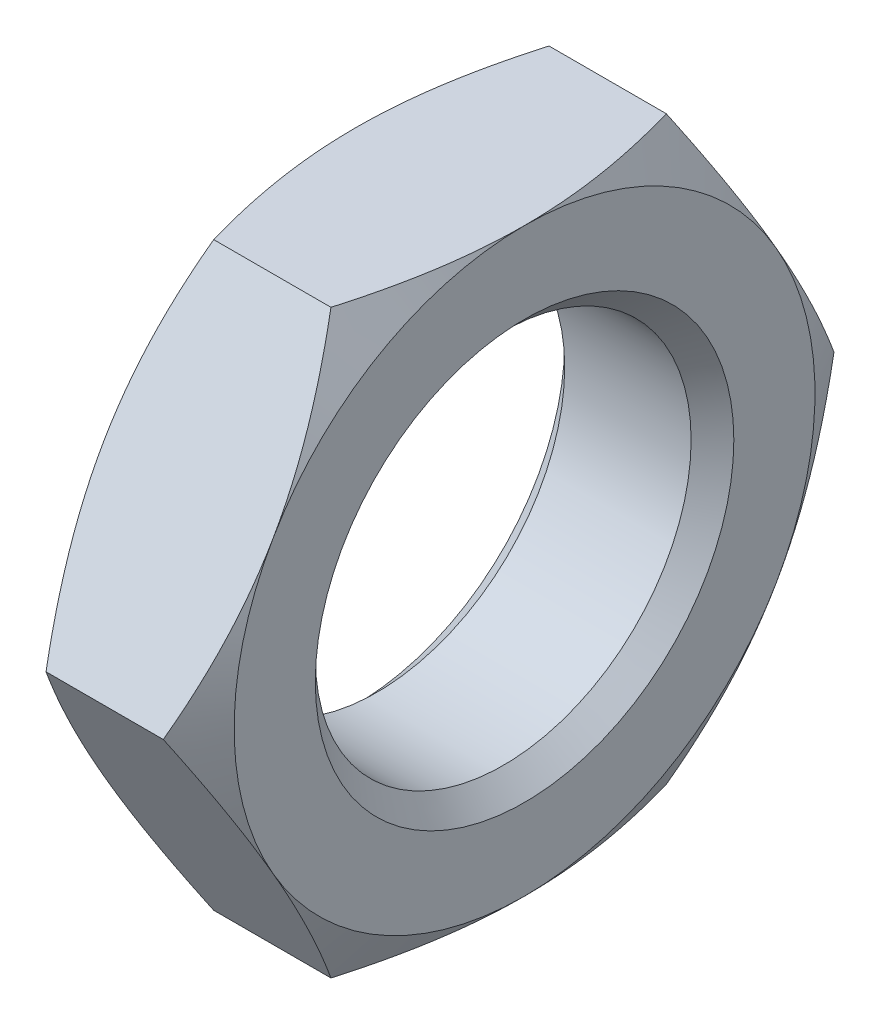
from build123d import *

# Parameters (mm, degrees)
SKETCH1_R      = 11
EXTRUDE1_DEPTH = 9.9
CHAMFER1_SIZE  = 1.25


with BuildPart() as part:
    # Sketch1 → Extrude1 (new body)
    with BuildSketch(Plane(origin=(0, 0, 0), x_dir=(0, 0, -1), z_dir=(1, 0, 0))):
        Polygon((9.814954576, 17), (-9.814954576, 17), (-19.629909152, 0), (-9.814954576, -17), (9.814954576, -17), (19.629909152, 0), align=None)
        with Locations(Location((0, 0, 0), (0, 0, 180))):
            Circle(SKETCH1_R, mode=Mode.SUBTRACT)
    extrude(amount=EXTRUDE1_DEPTH)

    # Sketch2 → Cut-Revolve1 (revolve, cut)
    with BuildSketch(Plane.XY):
        Polygon((9.9, 17), (9.9, 68), (0, 68), (0, 17), (4.95, 25.573651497), align=None)
    revolve(axis=Axis((9.9, 0, 0), (-1, 0, 0)), mode=Mode.SUBTRACT)

    # Chamfer1
    chamfer1_edges = [part.edges().sort_by_distance(p)[0] for p in [
        (0, 0, -11),
        (9.9, 0, -11),
    ]]
    chamfer(chamfer1_edges, length=CHAMFER1_SIZE)


solid = part.part
